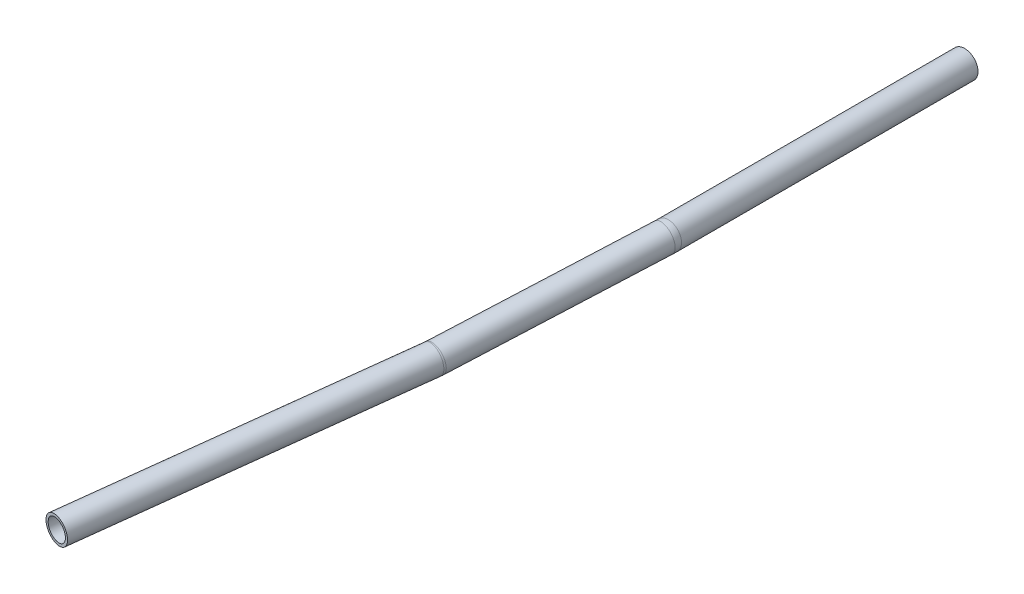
ISO-10303-21;
HEADER;
FILE_DESCRIPTION(('STEP AP214'),'2;1');
FILE_NAME('part.step','',(''),(''),'','','');
FILE_SCHEMA(('AUTOMOTIVE_DESIGN { 1 0 10303 214 1 1 1 1 }'));
ENDSEC;
DATA;
#1=APPLICATION_CONTEXT('core data for automotive mechanical design processes');
#2=APPLICATION_PROTOCOL_DEFINITION('international standard','automotive_design',2000,#1);
#3=PRODUCT_CONTEXT('',#1,'mechanical');
#4=PRODUCT('Part','Part','',(#3));
#5=PRODUCT_RELATED_PRODUCT_CATEGORY('part','',(#4));
#6=PRODUCT_DEFINITION_FORMATION('','',#4);
#7=PRODUCT_DEFINITION_CONTEXT('part definition',#1,'design');
#8=PRODUCT_DEFINITION('design','',#6,#7);
#9=PRODUCT_DEFINITION_SHAPE('','',#8);
#10=(LENGTH_UNIT() NAMED_UNIT(*) SI_UNIT(.MILLI.,.METRE.));
#11=(NAMED_UNIT(*) PLANE_ANGLE_UNIT() SI_UNIT($,.RADIAN.));
#12=(NAMED_UNIT(*) SI_UNIT($,.STERADIAN.) SOLID_ANGLE_UNIT());
#13=UNCERTAINTY_MEASURE_WITH_UNIT(LENGTH_MEASURE(1.E-05),#10,'distance_accuracy_value','');
#14=(GEOMETRIC_REPRESENTATION_CONTEXT(3) GLOBAL_UNCERTAINTY_ASSIGNED_CONTEXT((#13)) GLOBAL_UNIT_ASSIGNED_CONTEXT((#10,
#11,#12)) REPRESENTATION_CONTEXT('',''));
#15=CARTESIAN_POINT('',(0.,0.,0.));
#16=DIRECTION('',(0.,0.,1.));
#17=DIRECTION('',(1.,0.,0.));
#18=AXIS2_PLACEMENT_3D('',#15,#16,#17);
#19=CARTESIAN_POINT('',(-1.0376508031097,-0.654751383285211,18.8373456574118));
#20=DIRECTION('',(-0.179351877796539,-0.0555121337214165,0.982217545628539));
#21=DIRECTION('',(0.983734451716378,0.,0.179628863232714));
#22=AXIS2_PLACEMENT_3D('',#19,#20,#21);
#23=CYLINDRICAL_SURFACE('',#22,0.5);
#24=CARTESIAN_POINT('',(-1.0376508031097,-0.654751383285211,18.8373456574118));
#25=DIRECTION('',(-0.179351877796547,-0.0555121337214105,0.982217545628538));
#26=DIRECTION('',(0.983784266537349,-0.00891059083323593,0.179134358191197));
#27=AXIS2_PLACEMENT_3D('',#24,#25,#26);
#28=CIRCLE('',#27,0.5);
#29=CARTESIAN_POINT('',(-0.618331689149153,-0.920043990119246,18.8989192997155));
#30=VERTEX_POINT('',#29);
#31=EDGE_CURVE('E35',#30,#30,#28,.T.);
#32=ORIENTED_EDGE('',*,*,#31,.T.);
#33=EDGE_LOOP('',(#32));
#34=FACE_BOUND('',#33,.T.);
#35=CARTESIAN_POINT('',(-3.21005892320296,-1.32714473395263,30.7345022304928));
#36=DIRECTION('',(-0.179351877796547,-0.0555121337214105,0.982217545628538));
#37=DIRECTION('',(0.983784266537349,-0.00891059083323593,0.179134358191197));
#38=AXIS2_PLACEMENT_3D('',#35,#36,#37);
#39=CIRCLE('',#38,0.5);
#40=CARTESIAN_POINT('',(-2.71816678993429,-1.33160002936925,30.8240694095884));
#41=VERTEX_POINT('',#40);
#42=EDGE_CURVE('E10',#41,#41,#39,.T.);
#43=ORIENTED_EDGE('',*,*,#42,.F.);
#44=EDGE_LOOP('',(#43));
#45=FACE_BOUND('',#44,.T.);
#46=ADVANCED_FACE('F29',(#34,#45),#23,.T.);
#47=CARTESIAN_POINT('',(-1.87628903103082,-0.12416616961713,18.7141983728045));
#48=DIRECTION('',(-0.514313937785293,-0.845811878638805,-0.141716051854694));
#49=DIRECTION('',(0.854435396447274,-0.519557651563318,0.));
#50=AXIS2_PLACEMENT_3D('',#47,#48,#49);
#51=TOROIDAL_SURFACE('',#50,1.00000000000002,0.5);
#52=CARTESIAN_POINT('',(-1.02912023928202,-0.650935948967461,18.7836147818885));
#53=DIRECTION('',(-0.133364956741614,-0.0843555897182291,0.987470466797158));
#54=DIRECTION('',(0.991050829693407,-0.00566050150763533,0.133364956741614));
#55=AXIS2_PLACEMENT_3D('',#52,#53,#54);
#56=CIRCLE('',#55,0.5);
#57=CARTESIAN_POINT('',(-0.605535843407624,-0.914320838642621,18.8183229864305));
#58=VERTEX_POINT('',#57);
#59=EDGE_CURVE('E39',#58,#58,#56,.T.);
#60=CARTESIAN_POINT('',(-1.87628903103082,-0.12416616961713,18.7141983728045));
#61=DIRECTION('',(-0.514313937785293,-0.845811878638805,-0.141716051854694));
#62=DIRECTION('',(0.854435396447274,-0.519557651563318,0.));
#63=AXIS2_PLACEMENT_3D('',#60,#61,#62);
#64=CIRCLE('',#63,1.50000000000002);
#65=EDGE_CURVE('',#58,#30,#64,.T.);
#66=ORIENTED_EDGE('',*,*,#59,.T.);
#67=ORIENTED_EDGE('',*,*,#31,.F.);
#68=ORIENTED_EDGE('',*,*,#65,.T.);
#69=ORIENTED_EDGE('',*,*,#65,.F.);
#70=EDGE_LOOP('',(#66,#68,#67,#69));
#71=FACE_BOUND('',#70,.T.);
#72=ADVANCED_FACE('F97',(#71),#51,.T.);
#73=CARTESIAN_POINT('',(-0.0105890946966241,-0.00669778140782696,11.2421327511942));
#74=DIRECTION('',(-0.133364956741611,-0.0843555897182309,0.987470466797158));
#75=DIRECTION('',(0.991002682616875,0.,0.133842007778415));
#76=AXIS2_PLACEMENT_3D('',#73,#74,#75);
#77=CYLINDRICAL_SURFACE('',#76,0.5);
#78=CARTESIAN_POINT('',(-0.0105890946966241,-0.00669778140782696,11.2421327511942));
#79=DIRECTION('',(-0.133364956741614,-0.0843555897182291,0.987470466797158));
#80=DIRECTION('',(0.991050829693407,-0.00566050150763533,0.133364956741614));
#81=AXIS2_PLACEMENT_3D('',#78,#79,#80);
#82=CIRCLE('',#81,0.5);
#83=CARTESIAN_POINT('',(0.406681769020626,0.257233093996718,11.3210347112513));
#84=VERTEX_POINT('',#83);
#85=EDGE_CURVE('E43',#84,#84,#82,.T.);
#86=ORIENTED_EDGE('',*,*,#85,.T.);
#87=EDGE_LOOP('',(#86));
#88=FACE_BOUND('',#87,.T.);
#89=ORIENTED_EDGE('',*,*,#59,.F.);
#90=EDGE_LOOP('',(#89));
#91=FACE_BOUND('',#90,.T.);
#92=ADVANCED_FACE('F101',(#88,#91),#77,.T.);
#93=CARTESIAN_POINT('',(-0.845130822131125,-0.534559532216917,11.08432883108));
#94=DIRECTION('',(0.534559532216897,-0.845130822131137,0.));
#95=DIRECTION('',(0.845130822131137,0.534559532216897,0.));
#96=AXIS2_PLACEMENT_3D('',#93,#94,#95);
#97=TOROIDAL_SURFACE('',#96,1.,0.5);
#98=CARTESIAN_POINT('',(0.,0.,11.08432883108));
#99=DIRECTION('',(0.,0.,1.));
#100=DIRECTION('',(1.,0.,0.));
#101=AXIS2_PLACEMENT_3D('',#98,#99,#100);
#102=CIRCLE('',#101,0.5);
#103=CARTESIAN_POINT('',(0.422565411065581,0.267279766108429,11.08432883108));
#104=VERTEX_POINT('',#103);
#105=EDGE_CURVE('E48',#104,#104,#102,.T.);
#106=CARTESIAN_POINT('',(-0.845130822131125,-0.534559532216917,11.08432883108));
#107=DIRECTION('',(0.534559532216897,-0.845130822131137,0.));
#108=DIRECTION('',(0.845130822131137,0.534559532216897,0.));
#109=AXIS2_PLACEMENT_3D('',#106,#107,#108);
#110=CIRCLE('',#109,1.5);
#111=EDGE_CURVE('',#104,#84,#110,.T.);
#112=ORIENTED_EDGE('',*,*,#105,.T.);
#113=ORIENTED_EDGE('',*,*,#85,.F.);
#114=ORIENTED_EDGE('',*,*,#111,.T.);
#115=ORIENTED_EDGE('',*,*,#111,.F.);
#116=EDGE_LOOP('',(#112,#114,#113,#115));
#117=FACE_BOUND('',#116,.T.);
#118=ADVANCED_FACE('F92',(#117),#97,.T.);
#119=CARTESIAN_POINT('',(0.,0.,11.08432883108));
#120=DIRECTION('',(0.,0.,-1.));
#121=DIRECTION('',(0.,1.,0.));
#122=AXIS2_PLACEMENT_3D('',#119,#120,#121);
#123=CYLINDRICAL_SURFACE('',#122,0.5);
#124=ORIENTED_EDGE('',*,*,#105,.F.);
#125=EDGE_LOOP('',(#124));
#126=FACE_BOUND('',#125,.T.);
#127=CARTESIAN_POINT('',(0.,0.,0.));
#128=DIRECTION('',(0.,0.,1.));
#129=DIRECTION('',(1.,0.,0.));
#130=AXIS2_PLACEMENT_3D('',#127,#128,#129);
#131=CIRCLE('',#130,0.5);
#132=CARTESIAN_POINT('',(0.5,0.,0.));
#133=VERTEX_POINT('',#132);
#134=EDGE_CURVE('E49',#133,#133,#131,.T.);
#135=ORIENTED_EDGE('',*,*,#134,.T.);
#136=EDGE_LOOP('',(#135));
#137=FACE_BOUND('',#136,.T.);
#138=ADVANCED_FACE('F84',(#126,#137),#123,.T.);
#139=CARTESIAN_POINT('',(-3.21005892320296,-1.32714473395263,30.7345022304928));
#140=DIRECTION('',(-0.179351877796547,-0.0555121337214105,0.982217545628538));
#141=DIRECTION('',(0.983784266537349,-0.00891059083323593,0.179134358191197));
#142=AXIS2_PLACEMENT_3D('',#139,#140,#141);
#143=PLANE('',#142);
#144=CARTESIAN_POINT('',(-3.21005892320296,-1.32714473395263,30.7345022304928));
#145=DIRECTION('',(-0.179351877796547,-0.0555121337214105,0.982217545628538));
#146=DIRECTION('',(0.983734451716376,0.,0.179628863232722));
#147=AXIS2_PLACEMENT_3D('',#144,#145,#146);
#148=CIRCLE('',#147,0.4);
#149=CARTESIAN_POINT('',(-2.81656514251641,-1.32714473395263,30.8063537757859));
#150=VERTEX_POINT('',#149);
#151=EDGE_CURVE('E52',#150,#150,#148,.T.);
#152=ORIENTED_EDGE('',*,*,#151,.F.);
#153=EDGE_LOOP('',(#152));
#154=FACE_BOUND('',#153,.T.);
#155=ORIENTED_EDGE('',*,*,#42,.T.);
#156=EDGE_LOOP('',(#155));
#157=FACE_BOUND('',#156,.T.);
#158=ADVANCED_FACE('F82',(#154,#157),#143,.T.);
#159=CARTESIAN_POINT('',(0.,0.,0.));
#160=DIRECTION('',(0.,0.,1.));
#161=DIRECTION('',(1.,0.,0.));
#162=AXIS2_PLACEMENT_3D('',#159,#160,#161);
#163=PLANE('',#162);
#164=CARTESIAN_POINT('',(0.,0.,0.));
#165=DIRECTION('',(0.,0.,1.));
#166=DIRECTION('',(1.,0.,0.));
#167=AXIS2_PLACEMENT_3D('',#164,#165,#166);
#168=CIRCLE('',#167,0.4);
#169=CARTESIAN_POINT('',(0.4,0.,0.));
#170=VERTEX_POINT('',#169);
#171=EDGE_CURVE('E55',#170,#170,#168,.T.);
#172=ORIENTED_EDGE('',*,*,#171,.T.);
#173=EDGE_LOOP('',(#172));
#174=FACE_BOUND('',#173,.T.);
#175=ORIENTED_EDGE('',*,*,#134,.F.);
#176=EDGE_LOOP('',(#175));
#177=FACE_BOUND('',#176,.T.);
#178=ADVANCED_FACE('F78',(#174,#177),#163,.F.);
#179=CARTESIAN_POINT('',(-1.0376508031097,-0.654751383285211,18.8373456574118));
#180=DIRECTION('',(-0.179351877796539,-0.0555121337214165,0.982217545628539));
#181=DIRECTION('',(0.983734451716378,0.,0.179628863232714));
#182=AXIS2_PLACEMENT_3D('',#179,#180,#181);
#183=CYLINDRICAL_SURFACE('',#182,0.4);
#184=CARTESIAN_POINT('',(-1.0376508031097,-0.654751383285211,18.8373456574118));
#185=DIRECTION('',(-0.179351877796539,-0.0555121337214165,0.982217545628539));
#186=DIRECTION('',(0.983734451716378,0.,0.179628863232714));
#187=AXIS2_PLACEMENT_3D('',#184,#185,#186);
#188=CIRCLE('',#187,0.4);
#189=CARTESIAN_POINT('',(-0.702195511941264,-0.86698546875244,18.8866045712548));
#190=VERTEX_POINT('',#189);
#191=EDGE_CURVE('E61',#190,#190,#188,.T.);
#192=ORIENTED_EDGE('',*,*,#191,.F.);
#193=EDGE_LOOP('',(#192));
#194=FACE_BOUND('',#193,.T.);
#195=ORIENTED_EDGE('',*,*,#151,.T.);
#196=EDGE_LOOP('',(#195));
#197=FACE_BOUND('',#196,.T.);
#198=ADVANCED_FACE('F75',(#194,#197),#183,.F.);
#199=CARTESIAN_POINT('',(-1.87628903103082,-0.12416616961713,18.7141983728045));
#200=DIRECTION('',(-0.514313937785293,-0.845811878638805,-0.141716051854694));
#201=DIRECTION('',(0.854435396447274,-0.519557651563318,0.));
#202=AXIS2_PLACEMENT_3D('',#199,#200,#201);
#203=TOROIDAL_SURFACE('',#202,1.00000000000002,0.4);
#204=CARTESIAN_POINT('',(-1.02912023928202,-0.65093594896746,18.7836147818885));
#205=DIRECTION('',(0.1333649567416,0.0843555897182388,-0.987470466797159));
#206=DIRECTION('',(-0.991002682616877,0.,-0.133842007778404));
#207=AXIS2_PLACEMENT_3D('',#204,#205,#206);
#208=CIRCLE('',#207,0.4);
#209=CARTESIAN_POINT('',(-0.690252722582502,-0.861643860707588,18.8113813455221));
#210=VERTEX_POINT('',#209);
#211=EDGE_CURVE('E67',#210,#210,#208,.F.);
#212=CARTESIAN_POINT('',(-1.87628903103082,-0.12416616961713,18.7141983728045));
#213=DIRECTION('',(-0.514313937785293,-0.845811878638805,-0.141716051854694));
#214=DIRECTION('',(0.854435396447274,-0.519557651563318,0.));
#215=AXIS2_PLACEMENT_3D('',#212,#213,#214);
#216=CIRCLE('',#215,1.40000000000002);
#217=EDGE_CURVE('',#210,#190,#216,.T.);
#218=ORIENTED_EDGE('',*,*,#211,.F.);
#219=ORIENTED_EDGE('',*,*,#191,.T.);
#220=ORIENTED_EDGE('',*,*,#217,.T.);
#221=ORIENTED_EDGE('',*,*,#217,.F.);
#222=EDGE_LOOP('',(#218,#220,#219,#221));
#223=FACE_BOUND('',#222,.T.);
#224=ADVANCED_FACE('F73',(#223),#203,.F.);
#225=CARTESIAN_POINT('',(-0.0105890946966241,-0.00669778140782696,11.2421327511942));
#226=DIRECTION('',(-0.133364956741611,-0.0843555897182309,0.987470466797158));
#227=DIRECTION('',(0.991002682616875,0.,0.133842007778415));
#228=AXIS2_PLACEMENT_3D('',#225,#226,#227);
#229=CYLINDRICAL_SURFACE('',#228,0.4);
#230=CARTESIAN_POINT('',(-0.0105890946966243,-0.00669778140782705,11.2421327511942));
#231=DIRECTION('',(-0.133364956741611,-0.0843555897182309,0.987470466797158));
#232=DIRECTION('',(0.991002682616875,0.,0.133842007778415));
#233=AXIS2_PLACEMENT_3D('',#230,#231,#232);
#234=CIRCLE('',#233,0.4);
#235=CARTESIAN_POINT('',(0.323227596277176,0.204446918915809,11.3052543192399));
#236=VERTEX_POINT('',#235);
#237=EDGE_CURVE('E64',#236,#236,#234,.T.);
#238=ORIENTED_EDGE('',*,*,#237,.F.);
#239=EDGE_LOOP('',(#238));
#240=FACE_BOUND('',#239,.T.);
#241=ORIENTED_EDGE('',*,*,#211,.T.);
#242=EDGE_LOOP('',(#241));
#243=FACE_BOUND('',#242,.T.);
#244=ADVANCED_FACE('F154',(#240,#243),#229,.F.);
#245=CARTESIAN_POINT('',(-0.845130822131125,-0.534559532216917,11.08432883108));
#246=DIRECTION('',(0.534559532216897,-0.845130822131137,0.));
#247=DIRECTION('',(0.845130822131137,0.534559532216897,0.));
#248=AXIS2_PLACEMENT_3D('',#245,#246,#247);
#249=TOROIDAL_SURFACE('',#248,1.,0.4);
#250=CARTESIAN_POINT('',(0.,0.,11.08432883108));
#251=DIRECTION('',(0.,0.,-1.));
#252=DIRECTION('',(-1.,0.,0.));
#253=AXIS2_PLACEMENT_3D('',#250,#251,#252);
#254=CIRCLE('',#253,0.4);
#255=CARTESIAN_POINT('',(0.338052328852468,0.21382381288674,11.08432883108));
#256=VERTEX_POINT('',#255);
#257=EDGE_CURVE('E58',#256,#256,#254,.F.);
#258=CARTESIAN_POINT('',(-0.845130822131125,-0.534559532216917,11.08432883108));
#259=DIRECTION('',(0.534559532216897,-0.845130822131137,0.));
#260=DIRECTION('',(0.845130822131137,0.534559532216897,0.));
#261=AXIS2_PLACEMENT_3D('',#258,#259,#260);
#262=CIRCLE('',#261,1.4);
#263=EDGE_CURVE('',#256,#236,#262,.T.);
#264=ORIENTED_EDGE('',*,*,#257,.F.);
#265=ORIENTED_EDGE('',*,*,#237,.T.);
#266=ORIENTED_EDGE('',*,*,#263,.T.);
#267=ORIENTED_EDGE('',*,*,#263,.F.);
#268=EDGE_LOOP('',(#264,#266,#265,#267));
#269=FACE_BOUND('',#268,.T.);
#270=ADVANCED_FACE('F164',(#269),#249,.F.);
#271=CARTESIAN_POINT('',(0.,0.,11.08432883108));
#272=DIRECTION('',(0.,0.,-1.));
#273=DIRECTION('',(0.,1.,0.));
#274=AXIS2_PLACEMENT_3D('',#271,#272,#273);
#275=CYLINDRICAL_SURFACE('',#274,0.4);
#276=ORIENTED_EDGE('',*,*,#257,.T.);
#277=EDGE_LOOP('',(#276));
#278=FACE_BOUND('',#277,.T.);
#279=ORIENTED_EDGE('',*,*,#171,.F.);
#280=EDGE_LOOP('',(#279));
#281=FACE_BOUND('',#280,.T.);
#282=ADVANCED_FACE('F174',(#278,#281),#275,.F.);
#283=CLOSED_SHELL('',(#46,#72,#92,#118,#138,#158,#178,#198,#224,#244,#270,#282));
#284=MANIFOLD_SOLID_BREP('B2',#283);
#285=ADVANCED_BREP_SHAPE_REPRESENTATION('',(#18,#284),#14);
#286=SHAPE_DEFINITION_REPRESENTATION(#9,#285);
ENDSEC;
END-ISO-10303-21;
